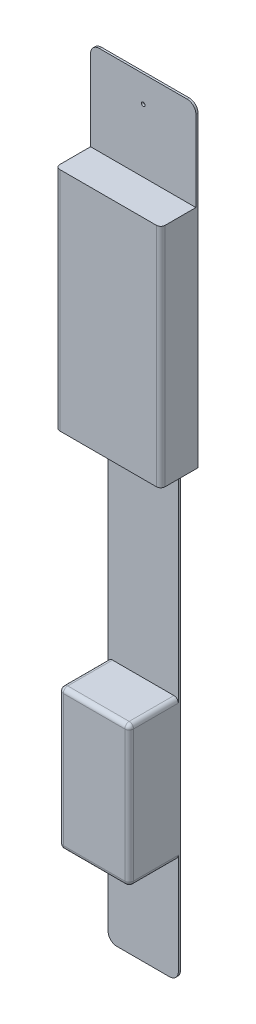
from build123d import *

# Parameters (mm, degrees)
BOSS_EXTRUDE1_DEPTH       = 1.524
FILLET1_R                 = 6.35
SKETCH2_W                 = 76.2
SKETCH2_H                 = 163.83
BOSS_EXTRUDE2_DEPTH       = 25.4
SKETCH3_W                 = 50.8
SKETCH3_H                 = 101.6
BOSS_EXTRUDE3_DEPTH       = 35.56
FILLET2_R                 = 3.175
TAP_DRILL_FOR_6_32_TAP1_D = 2.7051


with BuildPart() as part:
    # Sketch1 → Boss-Extrude1 (new body)
    with BuildSketch(Plane.XY):
        Polygon((-38.1, 0), (38.1, 0), (38.1, -228.6), (25.4, -228.6), (25.4, -556.26), (-25.4, -556.26), (-25.4, -228.6), (-38.1, -228.6), align=None)
    extrude(amount=BOSS_EXTRUDE1_DEPTH)

    # Fillet1
    fillet1_edges = [part.edges().sort_by_distance(p)[0] for p in [
        (-38.1, 0, 0.762),
        (38.1, 0, 0.762),
        (25.4, -556.26, 0.762),
        (-25.4, -556.26, 0.762),
    ]]
    fillet(fillet1_edges, radius=FILLET1_R)

    # Sketch2 → Boss-Extrude2 (add)
    with BuildSketch(Plane.XY.offset(1.524)):
        with Locations((0, -146.685)):
            Rectangle(SKETCH2_W, SKETCH2_H)
    extrude(amount=BOSS_EXTRUDE2_DEPTH)

    # Sketch3 → Boss-Extrude3 (add)
    with BuildSketch(Plane.XY.offset(1.524)):
        with Locations((0, -429.26)):
            Rectangle(SKETCH3_W, SKETCH3_H)
    extrude(amount=BOSS_EXTRUDE3_DEPTH)

    # Fillet2
    fillet2_edges = [part.edges().sort_by_distance(p)[0] for p in [
        (-38.1, -146.685, 26.924),
        (38.1, -146.685, 26.924),
        (-25.4, -378.46, 19.304),
        (-25.4, -480.06, 19.304),
        (25.4, -480.06, 19.304),
        (25.4, -378.46, 19.304),
        (-25.4, -429.26, 37.084),
        (0, -480.06, 37.084),
        (25.4, -429.26, 37.084),
        (0, -378.46, 37.084),
    ]]
    fillet(fillet2_edges, radius=FILLET2_R)

    # Tap Drill for _6-32 Tap1 (through all)
    with Locations(Plane(origin=(0, 0, 0), x_dir=(-1, 0, 0), z_dir=(0, 0, -1))):
        with Locations((0, -19.05), (0, -501.65)):
            Hole(TAP_DRILL_FOR_6_32_TAP1_D / 2)


solid = part.part
